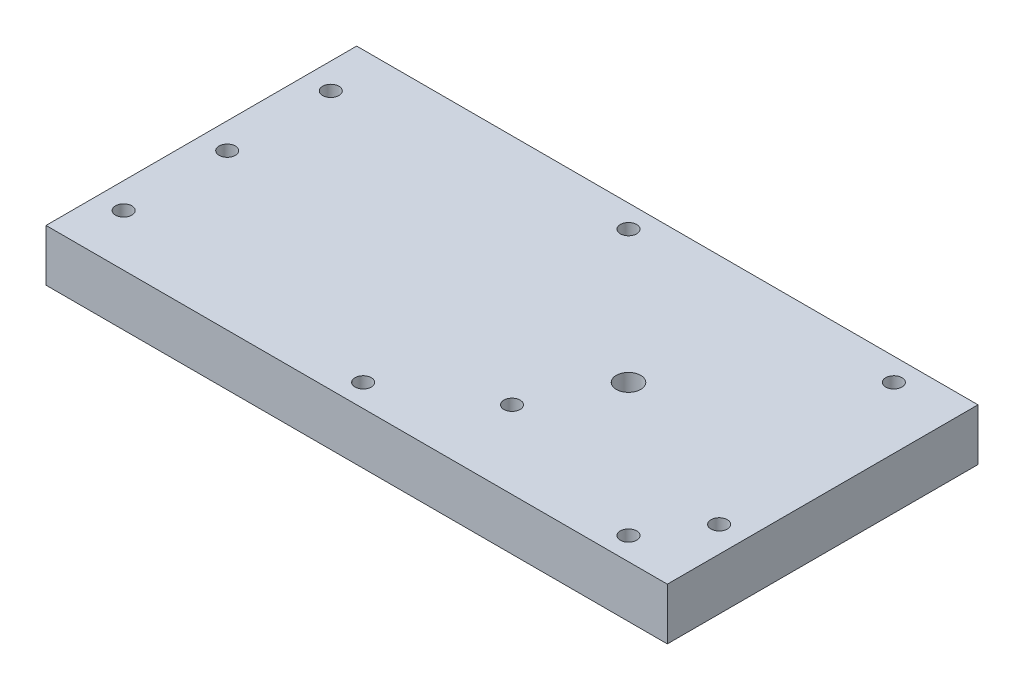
from build123d import *

# Parameters (mm, degrees)
SKETCH1_W           = 152.4
SKETCH1_H           = 76.2
BOSS_EXTRUDE1_DEPTH = 12.7
SKETCH2_R           = 2
CUT_EXTRUDE1_DEPTH  = 115.507436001
SKETCH3_R           = 3
CUT_EXTRUDE2_DEPTH  = 115.507436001
SKETCH4_R           = 2
CUT_EXTRUDE3_DEPTH  = 115.507436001
SKETCH6_R           = 2
CUT_EXTRUDE4_DEPTH  = 6.35


with BuildPart() as part:
    # Sketch1 → Boss-Extrude1 (new body)
    with BuildSketch(Plane(origin=(0, 0, 0), x_dir=(1, 0, 0), z_dir=(0, 1, 0))):
        with Locations((20.615337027, -21.711816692)):
            Rectangle(SKETCH1_W, SKETCH1_H)
    extrude(amount=BOSS_EXTRUDE1_DEPTH)

    # Sketch2 → Cut-Extrude1 (cut, through all)
    with BuildSketch(Plane(origin=(0, 12.7, 0), x_dir=(1, 0, 0), z_dir=(0, 1, 0))):
        with Locations(Location((-49.234662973, 3.688183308, 0), (0, 0, 270))):
            Circle(SKETCH2_R)
        with Locations(Location((-49.234662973, -21.711816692, 0), (0, 0, 270))):
            Circle(SKETCH2_R)
        with Locations(Location((-49.234662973, -47.111816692, 0), (0, 0, 270))):
            Circle(SKETCH2_R)
    extrude(amount=-CUT_EXTRUDE1_DEPTH, mode=Mode.SUBTRACT)

    # Sketch3 → Cut-Extrude2 (cut, through all)
    with BuildSketch(Plane(origin=(0, 12.7, 0), x_dir=(1, 0, 0), z_dir=(0, 1, 0))):
        with Locations(Location((49.190337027, -21.711816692, 0), (0, 0, 270))):
            Circle(SKETCH3_R)
    extrude(amount=-CUT_EXTRUDE2_DEPTH, mode=Mode.SUBTRACT)

    # Sketch4 → Cut-Extrude3 (cut, through all)
    with BuildSketch(Plane(origin=(0, 12.7, 0), x_dir=(1, 0, 0), z_dir=(0, 1, 0))):
        with Locations(Location((90.465337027, -40.761816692, 0), (0, 0, 270))):
            Circle(SKETCH4_R)
        with Locations(Location((39.665337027, -40.761816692, 0), (0, 0, 270))):
            Circle(SKETCH4_R)
    extrude(amount=-CUT_EXTRUDE3_DEPTH, mode=Mode.SUBTRACT)

    # Sketch6 → Cut-Extrude4 (cut)
    with BuildSketch(Plane(origin=(0, 12.7, 0), x_dir=(-1, 0, 0), z_dir=(0, 1, 0))):
        with Locations(Location((-16.646587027, -10.831933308, 0), (0, 0, 90))):
            Circle(SKETCH6_R)
        with Locations(Location((-16.646587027, 54.255566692, 0), (0, 0, 90))):
            Circle(SKETCH6_R)
        with Locations(Location((-81.734087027, 54.255566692, 0), (0, 0, 90))):
            Circle(SKETCH6_R)
        with Locations(Location((-81.734087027, -10.831933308, 0), (0, 0, 90))):
            Circle(SKETCH6_R)
    extrude(amount=-CUT_EXTRUDE4_DEPTH, mode=Mode.SUBTRACT)


solid = part.part
